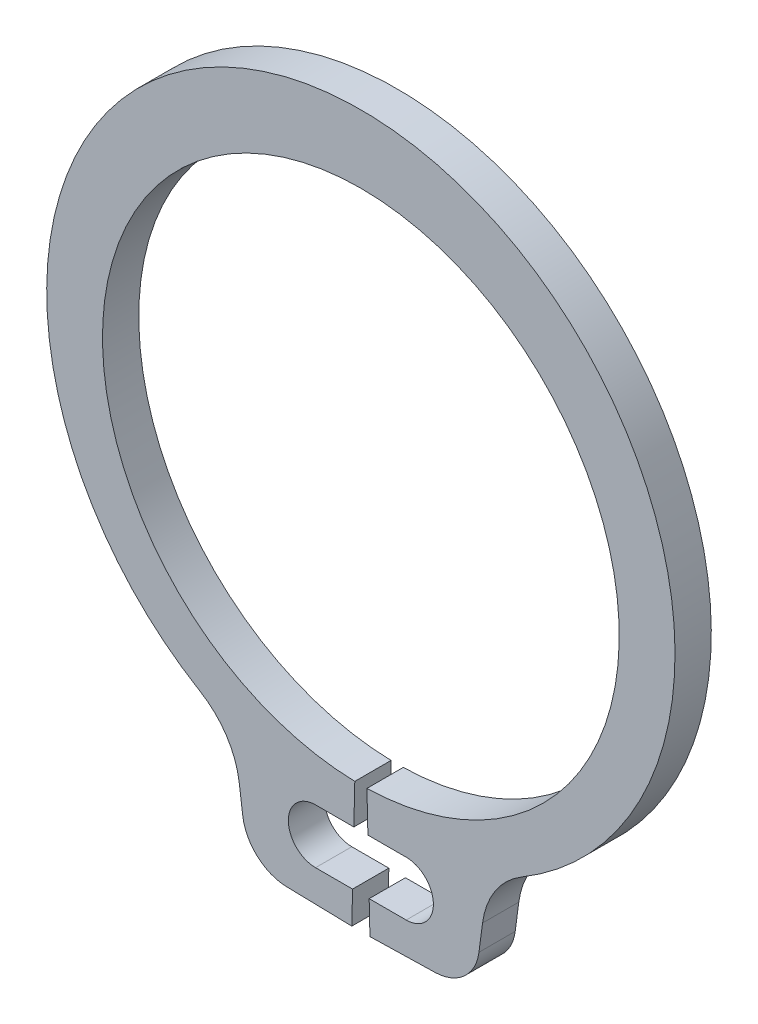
from build123d import *

# Parameters (mm, degrees)
BODYSKE_R   = 0.3
BODY_DEPTH  = 0.4
NOTSKE_W    = 1
NOTSKE_H    = 0.6
NOTCH_DEPTH = 6.497349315


with BuildPart() as part:
    # BodySke → Body (new body)
    with BuildSketch(Plane.XY):
        with BuildLine():
            Line((0.067058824, -2.849210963), (0.1, -4.248823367))
            Line((0.1, -4.248823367), (0.81853218, -4.231912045))
            ThreePointArc((0.81853218, -4.231912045), (1.140840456, -4.104065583), (1.302489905, -3.797313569))
            Line((1.302489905, -3.797313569), (1.341894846, -3.498003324))
            ThreePointArc((1.341894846, -3.498003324), (1.48244939, -3.120652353), (1.773511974, -2.842386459))
            ThreePointArc((1.773511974, -2.842386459), (0, 3.6), (-1.773511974, -2.842386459))
            ThreePointArc((-1.773511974, -2.842386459), (-1.48244939, -3.120652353), (-1.341894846, -3.498003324))
            Line((-1.341894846, -3.498003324), (-1.302489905, -3.797313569))
            ThreePointArc((-1.302489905, -3.797313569), (-1.140840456, -4.104065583), (-0.81853218, -4.231912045))
            Line((-0.81853218, -4.231912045), (-0.1, -4.248823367))
            Line((-0.1, -4.248823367), (-0.067058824, -2.849210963))
            ThreePointArc((-0.067058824, -2.849210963), (0, 2.85), (0.067058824, -2.849210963))
        make_face()
        with Locations((0.5, -3.590351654)):
            Circle(BODYSKE_R, mode=Mode.SUBTRACT)
        with Locations((-0.5, -3.590351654)):
            Circle(BODYSKE_R, mode=Mode.SUBTRACT)
    extrude(amount=-BODY_DEPTH)

    # NotSke → Notch (cut, through all)
    with BuildSketch(Plane.XY):
        with Locations((0, -3.590351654)):
            Rectangle(NOTSKE_W, NOTSKE_H)
    extrude(amount=-NOTCH_DEPTH, mode=Mode.SUBTRACT)


solid = part.part
